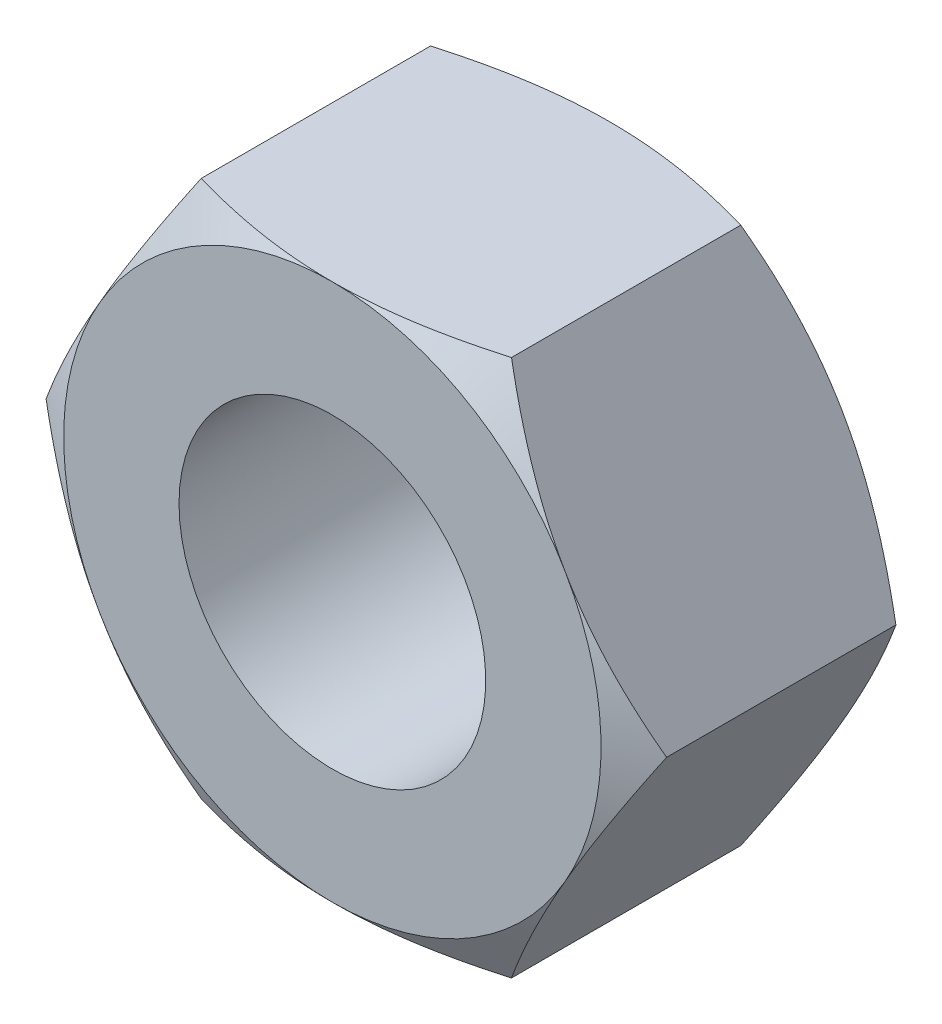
ISO-10303-21;
HEADER;
FILE_DESCRIPTION(('STEP AP214'),'2;1');
FILE_NAME('part.step','',(''),(''),'','','');
FILE_SCHEMA(('AUTOMOTIVE_DESIGN { 1 0 10303 214 1 1 1 1 }'));
ENDSEC;
DATA;
#1=APPLICATION_CONTEXT('core data for automotive mechanical design processes');
#2=APPLICATION_PROTOCOL_DEFINITION('international standard','automotive_design',2000,#1);
#3=PRODUCT_CONTEXT('',#1,'mechanical');
#4=PRODUCT('Part','Part','',(#3));
#5=PRODUCT_RELATED_PRODUCT_CATEGORY('part','',(#4));
#6=PRODUCT_DEFINITION_FORMATION('','',#4);
#7=PRODUCT_DEFINITION_CONTEXT('part definition',#1,'design');
#8=PRODUCT_DEFINITION('design','',#6,#7);
#9=PRODUCT_DEFINITION_SHAPE('','',#8);
#10=(LENGTH_UNIT() NAMED_UNIT(*) SI_UNIT(.MILLI.,.METRE.));
#11=(NAMED_UNIT(*) PLANE_ANGLE_UNIT() SI_UNIT($,.RADIAN.));
#12=(NAMED_UNIT(*) SI_UNIT($,.STERADIAN.) SOLID_ANGLE_UNIT());
#13=UNCERTAINTY_MEASURE_WITH_UNIT(LENGTH_MEASURE(1.E-05),#10,'distance_accuracy_value','');
#14=(GEOMETRIC_REPRESENTATION_CONTEXT(3) GLOBAL_UNCERTAINTY_ASSIGNED_CONTEXT((#13)) GLOBAL_UNIT_ASSIGNED_CONTEXT((#10,
#11,#12)) REPRESENTATION_CONTEXT('',''));
#15=CARTESIAN_POINT('',(0.,0.,0.));
#16=DIRECTION('',(0.,0.,1.));
#17=DIRECTION('',(1.,0.,0.));
#18=AXIS2_PLACEMENT_3D('',#15,#16,#17);
#19=CARTESIAN_POINT('',(-3.21156860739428,5.56259999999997,5.7404));
#20=DIRECTION('',(0.866025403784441,-0.499999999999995,0.));
#21=DIRECTION('',(0.499999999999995,0.866025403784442,0.));
#22=AXIS2_PLACEMENT_3D('',#19,#20,#21);
#23=PLANE('',#22);
#24=CARTESIAN_POINT('',(-3.21145313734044,5.56279999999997,5.24350193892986));
#25=CARTESIAN_POINT('',(-3.2820472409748,5.44052742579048,5.28425379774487));
#26=CARTESIAN_POINT('',(-3.35290455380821,5.3177989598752,5.32315622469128));
#27=CARTESIAN_POINT('',(-3.49519461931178,5.07134533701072,5.39675283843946));
#28=CARTESIAN_POINT('',(-3.56662760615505,4.94761977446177,5.43144520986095));
#29=CARTESIAN_POINT('',(-3.78207031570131,4.57446205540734,5.52852629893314));
#30=CARTESIAN_POINT('',(-3.92693047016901,4.323556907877,5.58374515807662));
#31=CARTESIAN_POINT('',(-4.14371105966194,3.9480819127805,5.64849621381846));
#32=CARTESIAN_POINT('',(-4.2149837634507,3.82463396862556,5.66694200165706));
#33=CARTESIAN_POINT('',(-4.35785122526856,3.57718026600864,5.69787310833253));
#34=CARTESIAN_POINT('',(-4.42944595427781,3.45317455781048,5.71035895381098));
#35=CARTESIAN_POINT('',(-4.57275976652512,3.20494775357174,5.72905197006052));
#36=CARTESIAN_POINT('',(-4.64447861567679,3.08072706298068,5.73526626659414));
#37=CARTESIAN_POINT('',(-4.78797861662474,2.83217777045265,5.74128959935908));
#38=CARTESIAN_POINT('',(-4.85975976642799,2.7078491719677,5.74109883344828));
#39=CARTESIAN_POINT('',(-5.05641945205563,2.36722460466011,5.73177189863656));
#40=CARTESIAN_POINT('',(-5.18123362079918,2.1510401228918,5.71611260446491));
#41=CARTESIAN_POINT('',(-5.43003294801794,1.72010704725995,5.66645567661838));
#42=CARTESIAN_POINT('',(-5.55401723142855,1.50535996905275,5.63244106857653));
#43=CARTESIAN_POINT('',(-5.80331731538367,1.07355955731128,5.54741395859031));
#44=CARTESIAN_POINT('',(-5.92860165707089,0.856560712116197,5.49604118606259));
#45=CARTESIAN_POINT('',(-6.177301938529,0.425799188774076,5.3794455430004));
#46=CARTESIAN_POINT('',(-6.30072106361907,0.21203099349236,5.31425006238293));
#47=CARTESIAN_POINT('',(-6.42325268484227,-0.000199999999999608,5.24350193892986));
#48=B_SPLINE_CURVE_WITH_KNOTS('',3,(#24,#25,#26,#27,#28,#29,#30,#31,#32,#33,#34,#35,#36,#37,#38,
#39,#40,#41,#42,#43,#44,#45,#46,#47),.UNSPECIFIED.,.F.,.F.,(4,2,2,2,2,2,2,2,2,2,2,4),(0.,
0.44082011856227,0.8818296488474,1.76568130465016,2.19678242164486,2.62784543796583,
3.05841812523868,3.48897751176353,4.23854798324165,4.98881282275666,5.75571809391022,
6.52111769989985),.UNSPECIFIED.);
#49=CARTESIAN_POINT('',(-3.21156860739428,5.56259999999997,5.24356860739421));
#50=VERTEX_POINT('',#49);
#51=CARTESIAN_POINT('',(-4.81735291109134,2.78129999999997,5.7404));
#52=VERTEX_POINT('',#51);
#53=EDGE_CURVE('E126',#50,#52,#48,.T.);
#54=ORIENTED_EDGE('',*,*,#53,.F.);
#55=DIRECTION('',(0.,0.,-1.));
#56=VECTOR('',#55,1.);
#57=CARTESIAN_POINT('',(-3.21156860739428,5.56259999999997,5.7404));
#58=LINE('',#57,#56);
#59=CARTESIAN_POINT('',(-3.21156860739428,5.56259999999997,0.496831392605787));
#60=VERTEX_POINT('',#59);
#61=EDGE_CURVE('E225',#50,#60,#58,.T.);
#62=ORIENTED_EDGE('',*,*,#61,.T.);
#63=CARTESIAN_POINT('',(-6.42325268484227,-0.000200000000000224,0.496898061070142));
#64=CARTESIAN_POINT('',(-6.35265858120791,0.122072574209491,0.45614620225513));
#65=CARTESIAN_POINT('',(-6.2818012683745,0.244801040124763,0.417243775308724));
#66=CARTESIAN_POINT('',(-6.13951120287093,0.491254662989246,0.343647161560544));
#67=CARTESIAN_POINT('',(-6.06807821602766,0.614980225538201,0.308954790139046));
#68=CARTESIAN_POINT('',(-5.8526355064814,0.988137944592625,0.211873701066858));
#69=CARTESIAN_POINT('',(-5.7077753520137,1.23904309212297,0.156654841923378));
#70=CARTESIAN_POINT('',(-5.49099476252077,1.61451808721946,0.0919037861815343));
#71=CARTESIAN_POINT('',(-5.41972205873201,1.7379660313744,0.0734579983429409));
#72=CARTESIAN_POINT('',(-5.27685459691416,1.98541973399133,0.0425268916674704));
#73=CARTESIAN_POINT('',(-5.2052598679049,2.10942544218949,0.0300410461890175));
#74=CARTESIAN_POINT('',(-5.06194605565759,2.35765224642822,0.0113480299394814));
#75=CARTESIAN_POINT('',(-4.99022720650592,2.48187293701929,0.00513373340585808));
#76=CARTESIAN_POINT('',(-4.84672720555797,2.73042222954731,-0.000889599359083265));
#77=CARTESIAN_POINT('',(-4.77494605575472,2.85475082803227,-0.000698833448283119));
#78=CARTESIAN_POINT('',(-4.57828637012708,3.19537539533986,0.00862810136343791));
#79=CARTESIAN_POINT('',(-4.45347220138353,3.41155987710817,0.0242873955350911));
#80=CARTESIAN_POINT('',(-4.20467287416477,3.84249295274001,0.0739443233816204));
#81=CARTESIAN_POINT('',(-4.08068859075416,4.05724003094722,0.107958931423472));
#82=CARTESIAN_POINT('',(-3.83138850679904,4.48904044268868,0.19298604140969));
#83=CARTESIAN_POINT('',(-3.70610416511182,4.70603928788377,0.244358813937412));
#84=CARTESIAN_POINT('',(-3.45740388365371,5.13680081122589,0.360954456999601));
#85=CARTESIAN_POINT('',(-3.33398475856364,5.35056900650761,0.426149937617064));
#86=CARTESIAN_POINT('',(-3.21145313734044,5.56279999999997,0.496898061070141));
#87=B_SPLINE_CURVE_WITH_KNOTS('',3,(#63,#64,#65,#66,#67,#68,#69,#70,#71,#72,#73,#74,#75,#76,#77,
#78,#79,#80,#81,#82,#83,#84,#85,#86),.UNSPECIFIED.,.F.,.F.,(4,2,2,2,2,2,2,2,2,2,2,4),(0.,
0.44082011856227,0.8818296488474,1.76568130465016,2.19678242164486,2.62784543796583,
3.05841812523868,3.48897751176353,4.23854798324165,4.98881282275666,5.75571809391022,
6.52111769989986),.UNSPECIFIED.);
#88=CARTESIAN_POINT('',(-4.81735291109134,2.78129999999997,0.));
#89=VERTEX_POINT('',#88);
#90=EDGE_CURVE('E285',#89,#60,#87,.T.);
#91=ORIENTED_EDGE('',*,*,#90,.F.);
#92=CARTESIAN_POINT('',(-6.42313721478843,0.,0.496831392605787));
#93=VERTEX_POINT('',#92);
#94=EDGE_CURVE('E278',#93,#89,#87,.T.);
#95=ORIENTED_EDGE('',*,*,#94,.F.);
#96=DIRECTION('',(0.,0.,-1.));
#97=VECTOR('',#96,1.);
#98=CARTESIAN_POINT('',(-6.42313721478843,0.,5.7404));
#99=LINE('',#98,#97);
#100=CARTESIAN_POINT('',(-6.42313721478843,0.,5.24356860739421));
#101=VERTEX_POINT('',#100);
#102=EDGE_CURVE('E149',#101,#93,#99,.T.);
#103=ORIENTED_EDGE('',*,*,#102,.F.);
#104=EDGE_CURVE('E135',#52,#101,#48,.T.);
#105=ORIENTED_EDGE('',*,*,#104,.F.);
#106=EDGE_LOOP('',(#54,#62,#91,#95,#103,#105));
#107=FACE_BOUND('',#106,.T.);
#108=ADVANCED_FACE('F38',(#107),#23,.F.);
#109=CARTESIAN_POINT('',(-6.42313721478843,0.,5.7404));
#110=DIRECTION('',(0.866025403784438,0.500000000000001,0.));
#111=DIRECTION('',(-0.500000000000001,0.866025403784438,0.));
#112=AXIS2_PLACEMENT_3D('',#109,#110,#111);
#113=PLANE('',#112);
#114=CARTESIAN_POINT('',(-6.42325268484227,0.000200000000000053,5.24350193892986));
#115=CARTESIAN_POINT('',(-6.35265858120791,-0.122072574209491,5.28425379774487));
#116=CARTESIAN_POINT('',(-6.2818012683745,-0.244801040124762,5.32315622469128));
#117=CARTESIAN_POINT('',(-6.13951120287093,-0.491254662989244,5.39675283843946));
#118=CARTESIAN_POINT('',(-6.06807821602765,-0.614980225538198,5.43144520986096));
#119=CARTESIAN_POINT('',(-5.85263550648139,-0.98813794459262,5.52852629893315));
#120=CARTESIAN_POINT('',(-5.70777535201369,-1.23904309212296,5.58374515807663));
#121=CARTESIAN_POINT('',(-5.49099476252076,-1.61451808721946,5.64849621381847));
#122=CARTESIAN_POINT('',(-5.41972205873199,-1.7379660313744,5.66694200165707));
#123=CARTESIAN_POINT('',(-5.27685459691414,-1.98541973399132,5.69787310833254));
#124=CARTESIAN_POINT('',(-5.20525986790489,-2.10942544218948,5.71035895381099));
#125=CARTESIAN_POINT('',(-5.06194605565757,-2.35765224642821,5.72905197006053));
#126=CARTESIAN_POINT('',(-4.9902272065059,-2.48187293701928,5.73526626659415));
#127=CARTESIAN_POINT('',(-4.84672720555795,-2.7304222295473,5.7412895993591));
#128=CARTESIAN_POINT('',(-4.7749460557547,-2.85475082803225,5.7410988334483));
#129=CARTESIAN_POINT('',(-4.57828637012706,-3.19537539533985,5.73177189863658));
#130=CARTESIAN_POINT('',(-4.4534722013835,-3.41155987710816,5.71611260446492));
#131=CARTESIAN_POINT('',(-4.20467287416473,-3.84249295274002,5.66645567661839));
#132=CARTESIAN_POINT('',(-4.08068859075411,-4.05724003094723,5.63244106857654));
#133=CARTESIAN_POINT('',(-3.83138850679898,-4.4890404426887,5.54741395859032));
#134=CARTESIAN_POINT('',(-3.70610416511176,-4.7060392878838,5.4960411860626));
#135=CARTESIAN_POINT('',(-3.45740388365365,-5.13680081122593,5.3794455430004));
#136=CARTESIAN_POINT('',(-3.33398475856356,-5.35056900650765,5.31425006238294));
#137=CARTESIAN_POINT('',(-3.21145313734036,-5.56280000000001,5.24350193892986));
#138=B_SPLINE_CURVE_WITH_KNOTS('',3,(#114,#115,#116,#117,#118,#119,#120,#121,#122,#123,#124,
#125,#126,#127,#128,#129,#130,#131,#132,#133,#134,#135,#136,#137),.UNSPECIFIED.,.F.,.F.,(4,2,2,
2,2,2,2,2,2,2,2,4),(0.,0.44082011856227,0.8818296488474,1.76568130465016,2.19678242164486,
2.62784543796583,3.05841812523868,3.48897751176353,4.23854798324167,4.9888128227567,
5.75571809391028,6.52111769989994),.UNSPECIFIED.);
#139=CARTESIAN_POINT('',(-4.81735291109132,-2.78130000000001,5.7404));
#140=VERTEX_POINT('',#139);
#141=EDGE_CURVE('E141',#101,#140,#138,.T.);
#142=ORIENTED_EDGE('',*,*,#141,.F.);
#143=ORIENTED_EDGE('',*,*,#102,.T.);
#144=CARTESIAN_POINT('',(-3.21145313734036,-5.56280000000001,0.496898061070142));
#145=CARTESIAN_POINT('',(-3.28204724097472,-5.44052742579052,0.45614620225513));
#146=CARTESIAN_POINT('',(-3.35290455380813,-5.31779895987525,0.417243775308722));
#147=CARTESIAN_POINT('',(-3.4951946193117,-5.07134533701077,0.343647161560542));
#148=CARTESIAN_POINT('',(-3.56662760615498,-4.94761977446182,0.308954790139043));
#149=CARTESIAN_POINT('',(-3.78207031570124,-4.57446205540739,0.211873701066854));
#150=CARTESIAN_POINT('',(-3.92693047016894,-4.32355690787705,0.156654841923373));
#151=CARTESIAN_POINT('',(-4.14371105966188,-3.94808191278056,0.0919037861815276));
#152=CARTESIAN_POINT('',(-4.21498376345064,-3.82463396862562,0.0734579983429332));
#153=CARTESIAN_POINT('',(-4.35785122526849,-3.57718026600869,0.0425268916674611));
#154=CARTESIAN_POINT('',(-4.42944595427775,-3.45317455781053,0.0300410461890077));
#155=CARTESIAN_POINT('',(-4.57275976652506,-3.2049477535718,0.0113480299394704));
#156=CARTESIAN_POINT('',(-4.64447861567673,-3.08072706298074,0.00513373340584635));
#157=CARTESIAN_POINT('',(-4.78797861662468,-2.83217777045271,-0.000889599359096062));
#158=CARTESIAN_POINT('',(-4.85975976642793,-2.70784917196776,-0.00069883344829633));
#159=CARTESIAN_POINT('',(-5.05641945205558,-2.36722460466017,0.00862810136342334));
#160=CARTESIAN_POINT('',(-5.18123362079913,-2.15104012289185,0.0242873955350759));
#161=CARTESIAN_POINT('',(-5.4300329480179,-1.72010704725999,0.0739443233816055));
#162=CARTESIAN_POINT('',(-5.55401723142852,-1.50535996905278,0.107958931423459));
#163=CARTESIAN_POINT('',(-5.80331731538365,-1.07355955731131,0.192986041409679));
#164=CARTESIAN_POINT('',(-5.92860165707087,-0.856560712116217,0.244358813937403));
#165=CARTESIAN_POINT('',(-6.17730193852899,-0.425799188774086,0.360954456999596));
#166=CARTESIAN_POINT('',(-6.30072106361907,-0.212030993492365,0.426149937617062));
#167=CARTESIAN_POINT('',(-6.42325268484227,0.000200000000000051,0.496898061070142));
#168=B_SPLINE_CURVE_WITH_KNOTS('',3,(#144,#145,#146,#147,#148,#149,#150,#151,#152,#153,#154,
#155,#156,#157,#158,#159,#160,#161,#162,#163,#164,#165,#166,#167),.UNSPECIFIED.,.F.,.F.,(4,2,2,
2,2,2,2,2,2,2,2,4),(0.,0.440820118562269,0.881829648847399,1.76568130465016,2.19678242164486,
2.62784543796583,3.05841812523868,3.48897751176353,4.23854798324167,4.9888128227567,
5.75571809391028,6.52111769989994),.UNSPECIFIED.);
#169=CARTESIAN_POINT('',(-4.81735291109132,-2.78130000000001,0.));
#170=VERTEX_POINT('',#169);
#171=EDGE_CURVE('E220',#170,#93,#168,.T.);
#172=ORIENTED_EDGE('',*,*,#171,.F.);
#173=CARTESIAN_POINT('',(-3.2115686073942,-5.56260000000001,0.496831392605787));
#174=VERTEX_POINT('',#173);
#175=EDGE_CURVE('E262',#174,#170,#168,.T.);
#176=ORIENTED_EDGE('',*,*,#175,.F.);
#177=DIRECTION('',(0.,0.,-1.));
#178=VECTOR('',#177,1.);
#179=CARTESIAN_POINT('',(-3.2115686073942,-5.56260000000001,5.7404));
#180=LINE('',#179,#178);
#181=CARTESIAN_POINT('',(-3.2115686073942,-5.56260000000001,5.24356860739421));
#182=VERTEX_POINT('',#181);
#183=EDGE_CURVE('E233',#182,#174,#180,.T.);
#184=ORIENTED_EDGE('',*,*,#183,.F.);
#185=EDGE_CURVE('E150',#140,#182,#138,.T.);
#186=ORIENTED_EDGE('',*,*,#185,.F.);
#187=EDGE_LOOP('',(#142,#143,#172,#176,#184,#186));
#188=FACE_BOUND('',#187,.T.);
#189=ADVANCED_FACE('F205',(#188),#113,.F.);
#190=CARTESIAN_POINT('',(-3.2115686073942,-5.56260000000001,5.7404));
#191=DIRECTION('',(0.,1.,0.));
#192=DIRECTION('',(-1.,0.,0.));
#193=AXIS2_PLACEMENT_3D('',#190,#191,#192);
#194=PLANE('',#193);
#195=CARTESIAN_POINT('',(-8.6317104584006,-5.56260000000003,3.02325474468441));
#196=CARTESIAN_POINT('',(-8.38864196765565,-5.56260000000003,3.14118500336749));
#197=CARTESIAN_POINT('',(-8.14501588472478,-5.56260000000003,3.2579856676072));
#198=CARTESIAN_POINT('',(-7.65635188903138,-5.56260000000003,3.48869234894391));
#199=CARTESIAN_POINT('',(-7.4113137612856,-5.56260000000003,3.60259791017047));
#200=CARTESIAN_POINT('',(-6.91826978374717,-5.56260000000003,3.82745050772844));
#201=CARTESIAN_POINT('',(-6.67025504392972,-5.56260000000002,3.93837811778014));
#202=CARTESIAN_POINT('',(-6.17225385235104,-5.56260000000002,4.15569824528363));
#203=CARTESIAN_POINT('',(-5.92226749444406,-5.56260000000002,4.26209097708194));
#204=CARTESIAN_POINT('',(-5.41198451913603,-5.56260000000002,4.47241674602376));
#205=CARTESIAN_POINT('',(-5.15161168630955,-5.56260000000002,4.57616588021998));
#206=CARTESIAN_POINT('',(-4.62782211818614,-5.56260000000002,4.77582417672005));
#207=CARTESIAN_POINT('',(-4.36440504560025,-5.56260000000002,4.87173246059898));
#208=CARTESIAN_POINT('',(-3.83459865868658,-5.56260000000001,5.0531961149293));
#209=CARTESIAN_POINT('',(-3.56821656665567,-5.56260000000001,5.13877236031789));
#210=CARTESIAN_POINT('',(-3.03163215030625,-5.56260000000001,5.29682996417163));
#211=CARTESIAN_POINT('',(-2.76143105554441,-5.56260000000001,5.36931543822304));
#212=CARTESIAN_POINT('',(-2.21848030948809,-5.56260000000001,5.49734982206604));
#213=CARTESIAN_POINT('',(-1.94575167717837,-5.56260000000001,5.55298622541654));
#214=CARTESIAN_POINT('',(-1.39689900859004,-5.56260000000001,5.6441537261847));
#215=CARTESIAN_POINT('',(-1.12077531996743,-5.5626,5.67968686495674));
#216=CARTESIAN_POINT('',(-0.570120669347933,-5.5626,5.72734880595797));
#217=CARTESIAN_POINT('',(-0.2956164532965,-5.5626,5.7397790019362));
#218=CARTESIAN_POINT('',(0.253470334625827,-5.5626,5.74097490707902));
#219=CARTESIAN_POINT('',(0.528052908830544,-5.5626,5.72973981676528));
#220=CARTESIAN_POINT('',(0.993940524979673,-5.5626,5.69139420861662));
#221=CARTESIAN_POINT('',(1.18574418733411,-5.5626,5.66999372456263));
#222=CARTESIAN_POINT('',(1.56794341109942,-5.56259999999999,5.6169736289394));
#223=CARTESIAN_POINT('',(1.75833877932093,-5.56259999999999,5.58535264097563));
#224=CARTESIAN_POINT('',(2.32715060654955,-5.56259999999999,5.47682168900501));
#225=CARTESIAN_POINT('',(2.70299153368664,-5.56259999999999,5.38626249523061));
#226=CARTESIAN_POINT('',(3.26522455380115,-5.56259999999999,5.22922577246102));
#227=CARTESIAN_POINT('',(3.45452696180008,-5.56259999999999,5.17257573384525));
#228=CARTESIAN_POINT('',(3.8312914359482,-5.56259999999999,5.0534011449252));
#229=CARTESIAN_POINT('',(4.01875348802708,-5.56259999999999,4.99087654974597));
#230=CARTESIAN_POINT('',(4.39190060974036,-5.56259999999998,4.86095581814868));
#231=CARTESIAN_POINT('',(4.57758621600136,-5.56259999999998,4.79356120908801));
#232=CARTESIAN_POINT('',(4.94741588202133,-5.56259999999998,4.65469270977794));
#233=CARTESIAN_POINT('',(5.13155997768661,-5.56259999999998,4.58321891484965));
#234=CARTESIAN_POINT('',(5.63445010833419,-5.56259999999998,4.3826490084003));
#235=CARTESIAN_POINT('',(5.95181868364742,-5.56259999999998,4.25010227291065));
#236=CARTESIAN_POINT('',(6.58329059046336,-5.56259999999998,3.97741963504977));
#237=CARTESIAN_POINT('',(6.89739355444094,-5.56259999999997,3.83728288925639));
#238=CARTESIAN_POINT('',(7.52310486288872,-5.56259999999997,3.55125530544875));
#239=CARTESIAN_POINT('',(7.83471220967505,-5.56259999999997,3.40536229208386));
#240=CARTESIAN_POINT('',(8.45582986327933,-5.56259999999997,3.10922556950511));
#241=CARTESIAN_POINT('',(8.76534025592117,-5.56259999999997,2.95898203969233));
#242=CARTESIAN_POINT('',(9.38317832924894,-5.56259999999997,2.65486700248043));
#243=CARTESIAN_POINT('',(9.69150336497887,-5.56259999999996,2.50099013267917));
#244=CARTESIAN_POINT('',(10.3067997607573,-5.56259999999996,2.19055134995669));
#245=CARTESIAN_POINT('',(10.613771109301,-5.56259999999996,2.03398941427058));
#246=CARTESIAN_POINT('',(11.2265387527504,-5.56259999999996,1.71874985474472));
#247=CARTESIAN_POINT('',(11.5323352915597,-5.56259999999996,1.56007270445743));
#248=CARTESIAN_POINT('',(12.1430151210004,-5.56259999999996,1.24096973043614));
#249=CARTESIAN_POINT('',(12.4478984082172,-5.56259999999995,1.08054390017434));
#250=CARTESIAN_POINT('',(13.2958613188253,-5.56259999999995,0.631811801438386));
#251=CARTESIAN_POINT('',(13.8381143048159,-5.56259999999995,0.341943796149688));
#252=CARTESIAN_POINT('',(14.9208810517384,-5.56259999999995,-0.241095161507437));
#253=CARTESIAN_POINT('',(15.4613947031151,-5.56259999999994,-0.534266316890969));
#254=CARTESIAN_POINT('',(16.539328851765,-5.56259999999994,-1.12209966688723));
#255=CARTESIAN_POINT('',(17.0767536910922,-5.56259999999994,-1.41675390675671));
#256=CARTESIAN_POINT('',(18.1505187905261,-5.56259999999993,-2.00793441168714));
#257=CARTESIAN_POINT('',(18.6868591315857,-5.56259999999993,-2.30446052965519));
#258=CARTESIAN_POINT('',(19.2228206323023,-5.56259999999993,-2.60166504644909));
#259=B_SPLINE_CURVE_WITH_KNOTS('',3,(#195,#196,#197,#198,#199,#200,#201,#202,#203,#204,#205,
#206,#207,#208,#209,#210,#211,#212,#213,#214,#215,#216,#217,#218,#219,#220,#221,#222,#223,#224,
#225,#226,#227,#228,#229,#230,#231,#232,#233,#234,#235,#236,#237,#238,#239,#240,#241,#242,#243,
#244,#245,#246,#247,#248,#249,#250,#251,#252,#253,#254,#255,#256,#257,#258),.UNSPECIFIED.,.F.,
.F.,(4,2,2,2,2,2,2,2,2,2,2,2,2,2,2,2,2,2,2,2,2,2,2,2,2,2,2,2,2,2,2,4),(0.,0.810508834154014,
1.62114451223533,2.43618252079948,3.25118196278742,4.09192980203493,4.93277170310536,
5.77188527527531,6.61073457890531,7.44515012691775,8.27948093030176,9.10284877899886,
9.9262444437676,10.5049457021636,11.0837249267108,12.2418870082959,12.8346280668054,
13.4273736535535,14.0199341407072,14.6124807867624,15.6441365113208,16.6759071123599,
17.7080714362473,18.7401932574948,19.7739475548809,20.8077106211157,21.8412460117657,
22.874785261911,24.7193693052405,26.5640673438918,28.4027634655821,30.241316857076),.UNSPECIFIED.);
#260=CARTESIAN_POINT('',(0.,-5.5626,5.7404));
#261=VERTEX_POINT('',#260);
#262=EDGE_CURVE('E199',#182,#261,#259,.T.);
#263=ORIENTED_EDGE('',*,*,#262,.F.);
#264=ORIENTED_EDGE('',*,*,#183,.T.);
#265=CARTESIAN_POINT('',(-8.6317104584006,-5.56260000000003,2.71714525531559));
#266=CARTESIAN_POINT('',(-8.38864196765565,-5.56260000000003,2.59921499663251));
#267=CARTESIAN_POINT('',(-8.14501588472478,-5.56260000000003,2.4824143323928));
#268=CARTESIAN_POINT('',(-7.65635188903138,-5.56260000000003,2.25170765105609));
#269=CARTESIAN_POINT('',(-7.4113137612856,-5.56260000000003,2.13780208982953));
#270=CARTESIAN_POINT('',(-6.91826978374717,-5.56260000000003,1.91294949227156));
#271=CARTESIAN_POINT('',(-6.67025504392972,-5.56260000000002,1.80202188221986));
#272=CARTESIAN_POINT('',(-6.17225385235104,-5.56260000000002,1.58470175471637));
#273=CARTESIAN_POINT('',(-5.92226749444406,-5.56260000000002,1.47830902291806));
#274=CARTESIAN_POINT('',(-5.41198451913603,-5.56260000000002,1.26798325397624));
#275=CARTESIAN_POINT('',(-5.15161168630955,-5.56260000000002,1.16423411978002));
#276=CARTESIAN_POINT('',(-4.62782211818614,-5.56260000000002,0.964575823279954));
#277=CARTESIAN_POINT('',(-4.36440504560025,-5.56260000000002,0.868667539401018));
#278=CARTESIAN_POINT('',(-3.83459865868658,-5.56260000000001,0.687203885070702));
#279=CARTESIAN_POINT('',(-3.56821656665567,-5.56260000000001,0.601627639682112));
#280=CARTESIAN_POINT('',(-3.03163215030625,-5.56260000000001,0.443570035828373));
#281=CARTESIAN_POINT('',(-2.76143105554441,-5.56260000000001,0.371084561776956));
#282=CARTESIAN_POINT('',(-2.21848030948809,-5.56260000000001,0.243050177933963));
#283=CARTESIAN_POINT('',(-1.94575167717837,-5.56260000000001,0.187413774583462));
#284=CARTESIAN_POINT('',(-1.39689900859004,-5.56260000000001,0.0962462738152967));
#285=CARTESIAN_POINT('',(-1.12077531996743,-5.5626,0.0607131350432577));
#286=CARTESIAN_POINT('',(-0.570120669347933,-5.5626,0.0130511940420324));
#287=CARTESIAN_POINT('',(-0.2956164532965,-5.5626,0.000620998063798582));
#288=CARTESIAN_POINT('',(0.253470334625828,-5.5626,-0.000574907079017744));
#289=CARTESIAN_POINT('',(0.528052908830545,-5.5626,0.0106601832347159));
#290=CARTESIAN_POINT('',(0.993940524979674,-5.5626,0.0490057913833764));
#291=CARTESIAN_POINT('',(1.18574418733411,-5.5626,0.0704062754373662));
#292=CARTESIAN_POINT('',(1.56794341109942,-5.56259999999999,0.123426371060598));
#293=CARTESIAN_POINT('',(1.75833877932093,-5.56259999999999,0.155047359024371));
#294=CARTESIAN_POINT('',(2.32715060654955,-5.56259999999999,0.263578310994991));
#295=CARTESIAN_POINT('',(2.70299153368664,-5.56259999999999,0.354137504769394));
#296=CARTESIAN_POINT('',(3.26522455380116,-5.56259999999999,0.511174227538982));
#297=CARTESIAN_POINT('',(3.45452696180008,-5.56259999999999,0.567824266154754));
#298=CARTESIAN_POINT('',(3.8312914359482,-5.56259999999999,0.686998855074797));
#299=CARTESIAN_POINT('',(4.01875348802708,-5.56259999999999,0.749523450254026));
#300=CARTESIAN_POINT('',(4.39190060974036,-5.56259999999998,0.879444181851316));
#301=CARTESIAN_POINT('',(4.57758621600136,-5.56259999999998,0.94683879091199));
#302=CARTESIAN_POINT('',(4.94741588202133,-5.56259999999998,1.08570729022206));
#303=CARTESIAN_POINT('',(5.13155997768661,-5.56259999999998,1.15718108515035));
#304=CARTESIAN_POINT('',(5.63445010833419,-5.56259999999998,1.35775099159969));
#305=CARTESIAN_POINT('',(5.95181868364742,-5.56259999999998,1.49029772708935));
#306=CARTESIAN_POINT('',(6.58329059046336,-5.56259999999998,1.76298036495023));
#307=CARTESIAN_POINT('',(6.89739355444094,-5.56259999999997,1.90311711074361));
#308=CARTESIAN_POINT('',(7.52310486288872,-5.56259999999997,2.18914469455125));
#309=CARTESIAN_POINT('',(7.83471220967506,-5.56259999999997,2.33503770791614));
#310=CARTESIAN_POINT('',(8.45582986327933,-5.56259999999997,2.63117443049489));
#311=CARTESIAN_POINT('',(8.76534025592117,-5.56259999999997,2.78141796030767));
#312=CARTESIAN_POINT('',(9.38317832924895,-5.56259999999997,3.08553299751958));
#313=CARTESIAN_POINT('',(9.69150336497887,-5.56259999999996,3.23940986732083));
#314=CARTESIAN_POINT('',(10.3067997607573,-5.56259999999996,3.54984865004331));
#315=CARTESIAN_POINT('',(10.613771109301,-5.56259999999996,3.70641058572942));
#316=CARTESIAN_POINT('',(11.2265387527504,-5.56259999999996,4.02165014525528));
#317=CARTESIAN_POINT('',(11.5323352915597,-5.56259999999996,4.18032729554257));
#318=CARTESIAN_POINT('',(12.1430151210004,-5.56259999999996,4.49943026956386));
#319=CARTESIAN_POINT('',(12.4478984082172,-5.56259999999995,4.65985609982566));
#320=CARTESIAN_POINT('',(13.2958613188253,-5.56259999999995,5.10858819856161));
#321=CARTESIAN_POINT('',(13.8381143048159,-5.56259999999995,5.39845620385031));
#322=CARTESIAN_POINT('',(14.9208810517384,-5.56259999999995,5.98149516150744));
#323=CARTESIAN_POINT('',(15.4613947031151,-5.56259999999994,6.27466631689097));
#324=CARTESIAN_POINT('',(16.539328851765,-5.56259999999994,6.86249966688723));
#325=CARTESIAN_POINT('',(17.0767536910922,-5.56259999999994,7.15715390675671));
#326=CARTESIAN_POINT('',(18.1505187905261,-5.56259999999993,7.74833441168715));
#327=CARTESIAN_POINT('',(18.6868591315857,-5.56259999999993,8.04486052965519));
#328=CARTESIAN_POINT('',(19.2228206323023,-5.56259999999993,8.34206504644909));
#329=B_SPLINE_CURVE_WITH_KNOTS('',3,(#265,#266,#267,#268,#269,#270,#271,#272,#273,#274,#275,
#276,#277,#278,#279,#280,#281,#282,#283,#284,#285,#286,#287,#288,#289,#290,#291,#292,#293,#294,
#295,#296,#297,#298,#299,#300,#301,#302,#303,#304,#305,#306,#307,#308,#309,#310,#311,#312,#313,
#314,#315,#316,#317,#318,#319,#320,#321,#322,#323,#324,#325,#326,#327,#328),.UNSPECIFIED.,.F.,
.F.,(4,2,2,2,2,2,2,2,2,2,2,2,2,2,2,2,2,2,2,2,2,2,2,2,2,2,2,2,2,2,2,4),(0.,0.810508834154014,
1.62114451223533,2.43618252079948,3.25118196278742,4.09192980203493,4.93277170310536,
5.77188527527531,6.61073457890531,7.44515012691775,8.27948093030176,9.10284877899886,
9.9262444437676,10.5049457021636,11.0837249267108,12.2418870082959,12.8346280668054,
13.4273736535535,14.0199341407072,14.6124807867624,15.6441365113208,16.6759071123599,
17.7080714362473,18.7401932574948,19.7739475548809,20.8077106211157,21.8412460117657,
22.874785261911,24.7193693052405,26.5640673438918,28.4027634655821,30.241316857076),.UNSPECIFIED.);
#330=CARTESIAN_POINT('',(0.,-5.5626,0.));
#331=VERTEX_POINT('',#330);
#332=EDGE_CURVE('E211',#331,#174,#329,.F.);
#333=ORIENTED_EDGE('',*,*,#332,.F.);
#334=CARTESIAN_POINT('',(3.21156860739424,-5.56259999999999,0.496831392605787));
#335=VERTEX_POINT('',#334);
#336=EDGE_CURVE('E218',#335,#331,#329,.F.);
#337=ORIENTED_EDGE('',*,*,#336,.F.);
#338=DIRECTION('',(0.,0.,-1.));
#339=VECTOR('',#338,1.);
#340=CARTESIAN_POINT('',(3.21156860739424,-5.56259999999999,5.7404));
#341=LINE('',#340,#339);
#342=CARTESIAN_POINT('',(3.21156860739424,-5.56259999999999,5.24356860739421));
#343=VERTEX_POINT('',#342);
#344=EDGE_CURVE('E231',#343,#335,#341,.T.);
#345=ORIENTED_EDGE('',*,*,#344,.F.);
#346=EDGE_CURVE('E194',#261,#343,#259,.T.);
#347=ORIENTED_EDGE('',*,*,#346,.F.);
#348=EDGE_LOOP('',(#263,#264,#333,#337,#345,#347));
#349=FACE_BOUND('',#348,.T.);
#350=ADVANCED_FACE('F201',(#349),#194,.F.);
#351=CARTESIAN_POINT('',(3.21156860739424,-5.56259999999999,5.7404));
#352=DIRECTION('',(-0.866025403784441,0.499999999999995,0.));
#353=DIRECTION('',(-0.499999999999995,-0.866025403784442,0.));
#354=AXIS2_PLACEMENT_3D('',#351,#352,#353);
#355=PLANE('',#354);
#356=CARTESIAN_POINT('',(3.2114531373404,-5.56279999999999,5.24350193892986));
#357=CARTESIAN_POINT('',(3.28204724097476,-5.4405274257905,5.28425379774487));
#358=CARTESIAN_POINT('',(3.35290455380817,-5.31779895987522,5.32315622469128));
#359=CARTESIAN_POINT('',(3.49519461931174,-5.07134533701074,5.39675283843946));
#360=CARTESIAN_POINT('',(3.56662760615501,-4.94761977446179,5.43144520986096));
#361=CARTESIAN_POINT('',(3.78207031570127,-4.57446205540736,5.52852629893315));
#362=CARTESIAN_POINT('',(3.92693047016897,-4.32355690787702,5.58374515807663));
#363=CARTESIAN_POINT('',(4.1437110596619,-3.94808191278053,5.64849621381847));
#364=CARTESIAN_POINT('',(4.21498376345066,-3.82463396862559,5.66694200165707));
#365=CARTESIAN_POINT('',(4.35785122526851,-3.57718026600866,5.69787310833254));
#366=CARTESIAN_POINT('',(4.42944595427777,-3.4531745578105,5.71035895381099));
#367=CARTESIAN_POINT('',(4.57275976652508,-3.20494775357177,5.72905197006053));
#368=CARTESIAN_POINT('',(4.64447861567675,-3.0807270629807,5.73526626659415));
#369=CARTESIAN_POINT('',(4.7879786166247,-2.83217777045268,5.7412895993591));
#370=CARTESIAN_POINT('',(4.85975976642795,-2.70784917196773,5.7410988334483));
#371=CARTESIAN_POINT('',(5.05641945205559,-2.36722460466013,5.73177189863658));
#372=CARTESIAN_POINT('',(5.18123362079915,-2.15104012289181,5.71611260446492));
#373=CARTESIAN_POINT('',(5.43003294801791,-1.72010704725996,5.66645567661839));
#374=CARTESIAN_POINT('',(5.55401723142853,-1.50535996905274,5.63244106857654));
#375=CARTESIAN_POINT('',(5.80331731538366,-1.07355955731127,5.54741395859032));
#376=CARTESIAN_POINT('',(5.92860165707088,-0.856560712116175,5.4960411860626));
#377=CARTESIAN_POINT('',(6.17730193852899,-0.425799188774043,5.3794455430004));
#378=CARTESIAN_POINT('',(6.30072106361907,-0.212030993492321,5.31425006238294));
#379=CARTESIAN_POINT('',(6.42325268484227,0.000200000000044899,5.24350193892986));
#380=B_SPLINE_CURVE_WITH_KNOTS('',3,(#356,#357,#358,#359,#360,#361,#362,#363,#364,#365,#366,
#367,#368,#369,#370,#371,#372,#373,#374,#375,#376,#377,#378,#379),.UNSPECIFIED.,.F.,.F.,(4,2,2,
2,2,2,2,2,2,2,2,4),(0.,0.44082011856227,0.8818296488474,1.76568130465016,2.19678242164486,
2.62784543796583,3.05841812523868,3.48897751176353,4.23854798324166,4.9888128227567,
5.75571809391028,6.52111769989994),.UNSPECIFIED.);
#381=CARTESIAN_POINT('',(4.81735291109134,-2.78129999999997,5.7404));
#382=VERTEX_POINT('',#381);
#383=EDGE_CURVE('E200',#343,#382,#380,.T.);
#384=ORIENTED_EDGE('',*,*,#383,.F.);
#385=ORIENTED_EDGE('',*,*,#344,.T.);
#386=CARTESIAN_POINT('',(6.42325268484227,0.000200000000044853,0.496898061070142));
#387=CARTESIAN_POINT('',(6.35265858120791,-0.122072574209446,0.45614620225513));
#388=CARTESIAN_POINT('',(6.2818012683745,-0.244801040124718,0.417243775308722));
#389=CARTESIAN_POINT('',(6.13951120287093,-0.491254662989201,0.343647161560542));
#390=CARTESIAN_POINT('',(6.06807821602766,-0.614980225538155,0.308954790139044));
#391=CARTESIAN_POINT('',(5.8526355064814,-0.98813794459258,0.211873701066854));
#392=CARTESIAN_POINT('',(5.7077753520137,-1.23904309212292,0.156654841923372));
#393=CARTESIAN_POINT('',(5.49099476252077,-1.61451808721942,0.0919037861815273));
#394=CARTESIAN_POINT('',(5.41972205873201,-1.73796603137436,0.0734579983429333));
#395=CARTESIAN_POINT('',(5.27685459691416,-1.98541973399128,0.0425268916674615));
#396=CARTESIAN_POINT('',(5.2052598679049,-2.10942544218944,0.0300410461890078));
#397=CARTESIAN_POINT('',(5.06194605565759,-2.35765224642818,0.0113480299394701));
#398=CARTESIAN_POINT('',(4.99022720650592,-2.48187293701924,0.00513373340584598));
#399=CARTESIAN_POINT('',(4.84672720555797,-2.73042222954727,-0.000889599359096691));
#400=CARTESIAN_POINT('',(4.77494605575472,-2.85475082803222,-0.000698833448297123));
#401=CARTESIAN_POINT('',(4.57828637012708,-3.19537539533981,0.00862810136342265));
#402=CARTESIAN_POINT('',(4.45347220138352,-3.41155987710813,0.0242873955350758));
#403=CARTESIAN_POINT('',(4.20467287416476,-3.84249295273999,0.0739443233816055));
#404=CARTESIAN_POINT('',(4.08068859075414,-4.0572400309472,0.107958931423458));
#405=CARTESIAN_POINT('',(3.83138850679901,-4.48904044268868,0.192986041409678));
#406=CARTESIAN_POINT('',(3.70610416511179,-4.70603928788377,0.244358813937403));
#407=CARTESIAN_POINT('',(3.45740388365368,-5.1368008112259,0.360954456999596));
#408=CARTESIAN_POINT('',(3.3339847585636,-5.35056900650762,0.426149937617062));
#409=CARTESIAN_POINT('',(3.2114531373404,-5.56279999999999,0.496898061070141));
#410=B_SPLINE_CURVE_WITH_KNOTS('',3,(#386,#387,#388,#389,#390,#391,#392,#393,#394,#395,#396,
#397,#398,#399,#400,#401,#402,#403,#404,#405,#406,#407,#408,#409),.UNSPECIFIED.,.F.,.F.,(4,2,2,
2,2,2,2,2,2,2,2,4),(0.,0.44082011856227,0.8818296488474,1.76568130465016,2.19678242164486,
2.62784543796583,3.05841812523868,3.48897751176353,4.23854798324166,4.9888128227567,
5.75571809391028,6.52111769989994),.UNSPECIFIED.);
#411=CARTESIAN_POINT('',(4.81735291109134,-2.78129999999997,0.));
#412=VERTEX_POINT('',#411);
#413=EDGE_CURVE('E219',#412,#335,#410,.T.);
#414=ORIENTED_EDGE('',*,*,#413,.F.);
#415=CARTESIAN_POINT('',(6.42313721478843,0.,0.496831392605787));
#416=VERTEX_POINT('',#415);
#417=EDGE_CURVE('E275',#416,#412,#410,.T.);
#418=ORIENTED_EDGE('',*,*,#417,.F.);
#419=DIRECTION('',(0.,0.,-1.));
#420=VECTOR('',#419,1.);
#421=CARTESIAN_POINT('',(6.42313721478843,0.,5.7404));
#422=LINE('',#421,#420);
#423=CARTESIAN_POINT('',(6.42313721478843,0.,5.24356860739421));
#424=VERTEX_POINT('',#423);
#425=EDGE_CURVE('E229',#424,#416,#422,.T.);
#426=ORIENTED_EDGE('',*,*,#425,.F.);
#427=EDGE_CURVE('E189',#382,#424,#380,.T.);
#428=ORIENTED_EDGE('',*,*,#427,.F.);
#429=EDGE_LOOP('',(#384,#385,#414,#418,#426,#428));
#430=FACE_BOUND('',#429,.T.);
#431=ADVANCED_FACE('F204',(#430),#355,.F.);
#432=CARTESIAN_POINT('',(6.42313721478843,0.,5.7404));
#433=DIRECTION('',(-0.866025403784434,-0.500000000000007,0.));
#434=DIRECTION('',(0.500000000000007,-0.866025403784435,0.));
#435=AXIS2_PLACEMENT_3D('',#432,#433,#434);
#436=PLANE('',#435);
#437=CARTESIAN_POINT('',(6.42325268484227,-0.000199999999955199,5.24350193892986));
#438=CARTESIAN_POINT('',(6.35265858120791,0.122072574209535,5.28425379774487));
#439=CARTESIAN_POINT('',(6.2818012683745,0.244801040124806,5.32315622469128));
#440=CARTESIAN_POINT('',(6.13951120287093,0.491254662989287,5.39675283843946));
#441=CARTESIAN_POINT('',(6.06807821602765,0.61498022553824,5.43144520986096));
#442=CARTESIAN_POINT('',(5.85263550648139,0.988137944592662,5.52852629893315));
#443=CARTESIAN_POINT('',(5.70777535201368,1.239043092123,5.58374515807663));
#444=CARTESIAN_POINT('',(5.49099476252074,1.61451808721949,5.64849621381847));
#445=CARTESIAN_POINT('',(5.41972205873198,1.73796603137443,5.66694200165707));
#446=CARTESIAN_POINT('',(5.27685459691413,1.98541973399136,5.69787310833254));
#447=CARTESIAN_POINT('',(5.20525986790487,2.10942544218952,5.71035895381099));
#448=CARTESIAN_POINT('',(5.06194605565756,2.35765224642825,5.72905197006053));
#449=CARTESIAN_POINT('',(4.99022720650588,2.48187293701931,5.73526626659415));
#450=CARTESIAN_POINT('',(4.84672720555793,2.73042222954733,5.7412895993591));
#451=CARTESIAN_POINT('',(4.77494605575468,2.85475082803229,5.7410988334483));
#452=CARTESIAN_POINT('',(4.57828637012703,3.19537539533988,5.73177189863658));
#453=CARTESIAN_POINT('',(4.45347220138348,3.41155987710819,5.71611260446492));
#454=CARTESIAN_POINT('',(4.20467287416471,3.84249295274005,5.6664556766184));
#455=CARTESIAN_POINT('',(4.08068859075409,4.05724003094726,5.63244106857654));
#456=CARTESIAN_POINT('',(3.83138850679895,4.48904044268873,5.54741395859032));
#457=CARTESIAN_POINT('',(3.70610416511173,4.70603928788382,5.4960411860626));
#458=CARTESIAN_POINT('',(3.45740388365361,5.13680081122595,5.3794455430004));
#459=CARTESIAN_POINT('',(3.33398475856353,5.35056900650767,5.31425006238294));
#460=CARTESIAN_POINT('',(3.21145313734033,5.56280000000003,5.24350193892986));
#461=B_SPLINE_CURVE_WITH_KNOTS('',3,(#437,#438,#439,#440,#441,#442,#443,#444,#445,#446,#447,
#448,#449,#450,#451,#452,#453,#454,#455,#456,#457,#458,#459,#460),.UNSPECIFIED.,.F.,.F.,(4,2,2,
2,2,2,2,2,2,2,2,4),(0.,0.44082011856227,0.881829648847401,1.76568130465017,2.19678242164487,
2.62784543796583,3.05841812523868,3.48897751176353,4.23854798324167,4.9888128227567,
5.75571809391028,6.52111769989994),.UNSPECIFIED.);
#462=CARTESIAN_POINT('',(4.8173529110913,2.78130000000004,5.7404));
#463=VERTEX_POINT('',#462);
#464=EDGE_CURVE('E478',#424,#463,#461,.T.);
#465=ORIENTED_EDGE('',*,*,#464,.F.);
#466=ORIENTED_EDGE('',*,*,#425,.T.);
#467=CARTESIAN_POINT('',(3.21145313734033,5.56280000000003,0.496898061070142));
#468=CARTESIAN_POINT('',(3.28204724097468,5.44052742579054,0.456146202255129));
#469=CARTESIAN_POINT('',(3.3529045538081,5.31779895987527,0.417243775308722));
#470=CARTESIAN_POINT('',(3.49519461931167,5.07134533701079,0.343647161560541));
#471=CARTESIAN_POINT('',(3.56662760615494,4.94761977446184,0.308954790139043));
#472=CARTESIAN_POINT('',(3.7820703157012,4.57446205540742,0.211873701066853));
#473=CARTESIAN_POINT('',(3.92693047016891,4.32355690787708,0.156654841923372));
#474=CARTESIAN_POINT('',(4.14371105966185,3.94808191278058,0.0919037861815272));
#475=CARTESIAN_POINT('',(4.21498376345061,3.82463396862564,0.0734579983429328));
#476=CARTESIAN_POINT('',(4.35785122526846,3.57718026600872,0.0425268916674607));
#477=CARTESIAN_POINT('',(4.42944595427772,3.45317455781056,0.0300410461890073));
#478=CARTESIAN_POINT('',(4.57275976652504,3.20494775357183,0.0113480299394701));
#479=CARTESIAN_POINT('',(4.64447861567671,3.08072706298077,0.00513373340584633));
#480=CARTESIAN_POINT('',(4.78797861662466,2.83217777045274,-0.00088959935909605));
#481=CARTESIAN_POINT('',(4.85975976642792,2.70784917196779,-0.000698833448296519));
#482=CARTESIAN_POINT('',(5.05641945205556,2.3672246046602,0.00862810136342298));
#483=CARTESIAN_POINT('',(5.18123362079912,2.15104012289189,0.0242873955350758));
#484=CARTESIAN_POINT('',(5.43003294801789,1.72010704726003,0.0739443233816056));
#485=CARTESIAN_POINT('',(5.55401723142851,1.50535996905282,0.107958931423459));
#486=CARTESIAN_POINT('',(5.80331731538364,1.07355955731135,0.192986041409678));
#487=CARTESIAN_POINT('',(5.92860165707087,0.856560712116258,0.244358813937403));
#488=CARTESIAN_POINT('',(6.17730193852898,0.425799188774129,0.360954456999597));
#489=CARTESIAN_POINT('',(6.30072106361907,0.212030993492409,0.426149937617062));
#490=CARTESIAN_POINT('',(6.42325268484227,-0.000199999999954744,0.496898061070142));
#491=B_SPLINE_CURVE_WITH_KNOTS('',3,(#467,#468,#469,#470,#471,#472,#473,#474,#475,#476,#477,
#478,#479,#480,#481,#482,#483,#484,#485,#486,#487,#488,#489,#490),.UNSPECIFIED.,.F.,.F.,(4,2,2,
2,2,2,2,2,2,2,2,4),(0.,0.44082011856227,0.8818296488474,1.76568130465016,2.19678242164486,
2.62784543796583,3.05841812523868,3.48897751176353,4.23854798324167,4.9888128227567,
5.75571809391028,6.52111769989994),.UNSPECIFIED.);
#492=CARTESIAN_POINT('',(4.8173529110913,2.78130000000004,0.));
#493=VERTEX_POINT('',#492);
#494=EDGE_CURVE('E276',#493,#416,#491,.T.);
#495=ORIENTED_EDGE('',*,*,#494,.F.);
#496=CARTESIAN_POINT('',(3.21156860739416,5.56260000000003,0.496831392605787));
#497=VERTEX_POINT('',#496);
#498=EDGE_CURVE('E280',#497,#493,#491,.T.);
#499=ORIENTED_EDGE('',*,*,#498,.F.);
#500=DIRECTION('',(0.,0.,-1.));
#501=VECTOR('',#500,1.);
#502=CARTESIAN_POINT('',(3.21156860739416,5.56260000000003,5.7404));
#503=LINE('',#502,#501);
#504=CARTESIAN_POINT('',(3.21156860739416,5.56260000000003,5.24356860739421));
#505=VERTEX_POINT('',#504);
#506=EDGE_CURVE('E227',#505,#497,#503,.T.);
#507=ORIENTED_EDGE('',*,*,#506,.F.);
#508=EDGE_CURVE('E183',#463,#505,#461,.T.);
#509=ORIENTED_EDGE('',*,*,#508,.F.);
#510=EDGE_LOOP('',(#465,#466,#495,#499,#507,#509));
#511=FACE_BOUND('',#510,.T.);
#512=ADVANCED_FACE('F298',(#511),#436,.F.);
#513=CARTESIAN_POINT('',(3.21156860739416,5.56260000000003,5.7404));
#514=DIRECTION('',(0.,-1.,0.));
#515=DIRECTION('',(1.,0.,0.));
#516=AXIS2_PLACEMENT_3D('',#513,#514,#515);
#517=PLANE('',#516);
#518=CARTESIAN_POINT('',(-8.63171045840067,5.56259999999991,3.02325474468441));
#519=CARTESIAN_POINT('',(-8.38864196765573,5.56259999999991,3.14118500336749));
#520=CARTESIAN_POINT('',(-8.14501588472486,5.56259999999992,3.2579856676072));
#521=CARTESIAN_POINT('',(-7.65635188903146,5.56259999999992,3.48869234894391));
#522=CARTESIAN_POINT('',(-7.41131376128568,5.56259999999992,3.60259791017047));
#523=CARTESIAN_POINT('',(-6.91826978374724,5.56259999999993,3.82745050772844));
#524=CARTESIAN_POINT('',(-6.6702550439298,5.56259999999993,3.93837811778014));
#525=CARTESIAN_POINT('',(-6.17225385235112,5.56259999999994,4.15569824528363));
#526=CARTESIAN_POINT('',(-5.92226749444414,5.56259999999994,4.26209097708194));
#527=CARTESIAN_POINT('',(-5.41198451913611,5.56259999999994,4.47241674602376));
#528=CARTESIAN_POINT('',(-5.15161168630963,5.56259999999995,4.57616588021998));
#529=CARTESIAN_POINT('',(-4.62782211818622,5.56259999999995,4.77582417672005));
#530=CARTESIAN_POINT('',(-4.36440504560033,5.56259999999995,4.87173246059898));
#531=CARTESIAN_POINT('',(-3.83459865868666,5.56259999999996,5.0531961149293));
#532=CARTESIAN_POINT('',(-3.56821656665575,5.56259999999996,5.13877236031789));
#533=CARTESIAN_POINT('',(-3.03163215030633,5.56259999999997,5.29682996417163));
#534=CARTESIAN_POINT('',(-2.76143105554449,5.56259999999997,5.36931543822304));
#535=CARTESIAN_POINT('',(-2.21848030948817,5.56259999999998,5.49734982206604));
#536=CARTESIAN_POINT('',(-1.94575167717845,5.56259999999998,5.55298622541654));
#537=CARTESIAN_POINT('',(-1.39689900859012,5.56259999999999,5.6441537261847));
#538=CARTESIAN_POINT('',(-1.12077531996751,5.56259999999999,5.67968686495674));
#539=CARTESIAN_POINT('',(-0.570120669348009,5.56259999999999,5.72734880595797));
#540=CARTESIAN_POINT('',(-0.295616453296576,5.5626,5.7397790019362));
#541=CARTESIAN_POINT('',(0.253470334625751,5.5626,5.74097490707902));
#542=CARTESIAN_POINT('',(0.528052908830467,5.56260000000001,5.72973981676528));
#543=CARTESIAN_POINT('',(0.993940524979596,5.56260000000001,5.69139420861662));
#544=CARTESIAN_POINT('',(1.18574418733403,5.56260000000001,5.66999372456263));
#545=CARTESIAN_POINT('',(1.56794341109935,5.56260000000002,5.6169736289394));
#546=CARTESIAN_POINT('',(1.75833877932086,5.56260000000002,5.58535264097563));
#547=CARTESIAN_POINT('',(2.32715060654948,5.56260000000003,5.47682168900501));
#548=CARTESIAN_POINT('',(2.70299153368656,5.56260000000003,5.38626249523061));
#549=CARTESIAN_POINT('',(3.26522455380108,5.56260000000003,5.22922577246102));
#550=CARTESIAN_POINT('',(3.4545269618,5.56260000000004,5.17257573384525));
#551=CARTESIAN_POINT('',(3.83129143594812,5.56260000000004,5.0534011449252));
#552=CARTESIAN_POINT('',(4.018753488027,5.56260000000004,4.99087654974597));
#553=CARTESIAN_POINT('',(4.39190060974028,5.56260000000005,4.86095581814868));
#554=CARTESIAN_POINT('',(4.57758621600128,5.56260000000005,4.79356120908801));
#555=CARTESIAN_POINT('',(4.94741588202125,5.56260000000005,4.65469270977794));
#556=CARTESIAN_POINT('',(5.13155997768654,5.56260000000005,4.58321891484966));
#557=CARTESIAN_POINT('',(5.63445010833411,5.56260000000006,4.38264900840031));
#558=CARTESIAN_POINT('',(5.95181868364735,5.56260000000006,4.25010227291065));
#559=CARTESIAN_POINT('',(6.58329059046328,5.56260000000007,3.97741963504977));
#560=CARTESIAN_POINT('',(6.89739355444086,5.56260000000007,3.83728288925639));
#561=CARTESIAN_POINT('',(7.52310486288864,5.56260000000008,3.55125530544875));
#562=CARTESIAN_POINT('',(7.83471220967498,5.56260000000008,3.40536229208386));
#563=CARTESIAN_POINT('',(8.45582986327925,5.56260000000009,3.10922556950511));
#564=CARTESIAN_POINT('',(8.76534025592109,5.56260000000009,2.95898203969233));
#565=CARTESIAN_POINT('',(9.38317832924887,5.5626000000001,2.65486700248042));
#566=CARTESIAN_POINT('',(9.69150336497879,5.5626000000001,2.50099013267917));
#567=CARTESIAN_POINT('',(10.3067997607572,5.56260000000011,2.19055134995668));
#568=CARTESIAN_POINT('',(10.6137711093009,5.56260000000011,2.03398941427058));
#569=CARTESIAN_POINT('',(11.2265387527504,5.56260000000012,1.71874985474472));
#570=CARTESIAN_POINT('',(11.5323352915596,5.56260000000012,1.56007270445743));
#571=CARTESIAN_POINT('',(12.1430151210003,5.56260000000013,1.24096973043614));
#572=CARTESIAN_POINT('',(12.4478984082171,5.56260000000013,1.08054390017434));
#573=CARTESIAN_POINT('',(13.2958613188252,5.56260000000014,0.631811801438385));
#574=CARTESIAN_POINT('',(13.8381143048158,5.56260000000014,0.34194379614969));
#575=CARTESIAN_POINT('',(14.9208810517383,5.56260000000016,-0.241095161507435));
#576=CARTESIAN_POINT('',(15.461394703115,5.56260000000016,-0.534266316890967));
#577=CARTESIAN_POINT('',(16.5393288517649,5.56260000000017,-1.12209966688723));
#578=CARTESIAN_POINT('',(17.0767536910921,5.56260000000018,-1.41675390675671));
#579=CARTESIAN_POINT('',(18.150518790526,5.56260000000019,-2.00793441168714));
#580=CARTESIAN_POINT('',(18.6868591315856,5.5626000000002,-2.30446052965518));
#581=CARTESIAN_POINT('',(19.2228206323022,5.5626000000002,-2.60166504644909));
#582=B_SPLINE_CURVE_WITH_KNOTS('',3,(#518,#519,#520,#521,#522,#523,#524,#525,#526,#527,#528,
#529,#530,#531,#532,#533,#534,#535,#536,#537,#538,#539,#540,#541,#542,#543,#544,#545,#546,#547,
#548,#549,#550,#551,#552,#553,#554,#555,#556,#557,#558,#559,#560,#561,#562,#563,#564,#565,#566,
#567,#568,#569,#570,#571,#572,#573,#574,#575,#576,#577,#578,#579,#580,#581),.UNSPECIFIED.,.F.,
.F.,(4,2,2,2,2,2,2,2,2,2,2,2,2,2,2,2,2,2,2,2,2,2,2,2,2,2,2,2,2,2,2,4),(0.,0.810508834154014,
1.62114451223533,2.43618252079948,3.25118196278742,4.09192980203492,4.93277170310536,
5.77188527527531,6.61073457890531,7.44515012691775,8.27948093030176,9.10284877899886,
9.9262444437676,10.5049457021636,11.0837249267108,12.2418870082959,12.8346280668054,
13.4273736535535,14.0199341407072,14.6124807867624,15.6441365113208,16.6759071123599,
17.7080714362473,18.7401932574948,19.7739475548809,20.8077106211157,21.8412460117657,
22.874785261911,24.7193693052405,26.5640673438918,28.4027634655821,30.241316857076),.UNSPECIFIED.);
#583=CARTESIAN_POINT('',(0.,5.5626,5.7404));
#584=VERTEX_POINT('',#583);
#585=EDGE_CURVE('E479',#505,#584,#582,.F.);
#586=ORIENTED_EDGE('',*,*,#585,.F.);
#587=ORIENTED_EDGE('',*,*,#506,.T.);
#588=CARTESIAN_POINT('',(-8.63171045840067,5.56259999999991,2.71714525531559));
#589=CARTESIAN_POINT('',(-8.38864196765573,5.56259999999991,2.59921499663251));
#590=CARTESIAN_POINT('',(-8.14501588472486,5.56259999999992,2.4824143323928));
#591=CARTESIAN_POINT('',(-7.65635188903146,5.56259999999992,2.25170765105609));
#592=CARTESIAN_POINT('',(-7.41131376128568,5.56259999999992,2.13780208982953));
#593=CARTESIAN_POINT('',(-6.91826978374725,5.56259999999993,1.91294949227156));
#594=CARTESIAN_POINT('',(-6.6702550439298,5.56259999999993,1.80202188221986));
#595=CARTESIAN_POINT('',(-6.17225385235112,5.56259999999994,1.58470175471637));
#596=CARTESIAN_POINT('',(-5.92226749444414,5.56259999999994,1.47830902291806));
#597=CARTESIAN_POINT('',(-5.41198451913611,5.56259999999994,1.26798325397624));
#598=CARTESIAN_POINT('',(-5.15161168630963,5.56259999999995,1.16423411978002));
#599=CARTESIAN_POINT('',(-4.62782211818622,5.56259999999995,0.964575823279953));
#600=CARTESIAN_POINT('',(-4.36440504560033,5.56259999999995,0.868667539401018));
#601=CARTESIAN_POINT('',(-3.83459865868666,5.56259999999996,0.687203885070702));
#602=CARTESIAN_POINT('',(-3.56821656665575,5.56259999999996,0.601627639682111));
#603=CARTESIAN_POINT('',(-3.03163215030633,5.56259999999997,0.443570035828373));
#604=CARTESIAN_POINT('',(-2.76143105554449,5.56259999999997,0.371084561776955));
#605=CARTESIAN_POINT('',(-2.21848030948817,5.56259999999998,0.243050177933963));
#606=CARTESIAN_POINT('',(-1.94575167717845,5.56259999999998,0.187413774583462));
#607=CARTESIAN_POINT('',(-1.39689900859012,5.56259999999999,0.0962462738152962));
#608=CARTESIAN_POINT('',(-1.12077531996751,5.56259999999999,0.0607131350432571));
#609=CARTESIAN_POINT('',(-0.57012066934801,5.56259999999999,0.0130511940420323));
#610=CARTESIAN_POINT('',(-0.295616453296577,5.5626,0.000620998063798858));
#611=CARTESIAN_POINT('',(0.253470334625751,5.5626,-0.000574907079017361));
#612=CARTESIAN_POINT('',(0.528052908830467,5.56260000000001,0.010660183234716));
#613=CARTESIAN_POINT('',(0.993940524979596,5.56260000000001,0.0490057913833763));
#614=CARTESIAN_POINT('',(1.18574418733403,5.56260000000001,0.0704062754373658));
#615=CARTESIAN_POINT('',(1.56794341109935,5.56260000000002,0.123426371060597));
#616=CARTESIAN_POINT('',(1.75833877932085,5.56260000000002,0.155047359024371));
#617=CARTESIAN_POINT('',(2.32715060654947,5.56260000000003,0.263578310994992));
#618=CARTESIAN_POINT('',(2.70299153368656,5.56260000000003,0.354137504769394));
#619=CARTESIAN_POINT('',(3.26522455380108,5.56260000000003,0.511174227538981));
#620=CARTESIAN_POINT('',(3.4545269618,5.56260000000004,0.567824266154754));
#621=CARTESIAN_POINT('',(3.83129143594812,5.56260000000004,0.686998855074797));
#622=CARTESIAN_POINT('',(4.018753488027,5.56260000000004,0.749523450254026));
#623=CARTESIAN_POINT('',(4.39190060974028,5.56260000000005,0.879444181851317));
#624=CARTESIAN_POINT('',(4.57758621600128,5.56260000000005,0.94683879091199));
#625=CARTESIAN_POINT('',(4.94741588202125,5.56260000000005,1.08570729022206));
#626=CARTESIAN_POINT('',(5.13155997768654,5.56260000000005,1.15718108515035));
#627=CARTESIAN_POINT('',(5.63445010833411,5.56260000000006,1.3577509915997));
#628=CARTESIAN_POINT('',(5.95181868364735,5.56260000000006,1.49029772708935));
#629=CARTESIAN_POINT('',(6.58329059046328,5.56260000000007,1.76298036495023));
#630=CARTESIAN_POINT('',(6.89739355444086,5.56260000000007,1.90311711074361));
#631=CARTESIAN_POINT('',(7.52310486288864,5.56260000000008,2.18914469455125));
#632=CARTESIAN_POINT('',(7.83471220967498,5.56260000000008,2.33503770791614));
#633=CARTESIAN_POINT('',(8.45582986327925,5.56260000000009,2.63117443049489));
#634=CARTESIAN_POINT('',(8.76534025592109,5.56260000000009,2.78141796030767));
#635=CARTESIAN_POINT('',(9.38317832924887,5.5626000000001,3.08553299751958));
#636=CARTESIAN_POINT('',(9.69150336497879,5.5626000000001,3.23940986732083));
#637=CARTESIAN_POINT('',(10.3067997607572,5.56260000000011,3.54984865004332));
#638=CARTESIAN_POINT('',(10.6137711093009,5.56260000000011,3.70641058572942));
#639=CARTESIAN_POINT('',(11.2265387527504,5.56260000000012,4.02165014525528));
#640=CARTESIAN_POINT('',(11.5323352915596,5.56260000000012,4.18032729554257));
#641=CARTESIAN_POINT('',(12.1430151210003,5.56260000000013,4.49943026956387));
#642=CARTESIAN_POINT('',(12.4478984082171,5.56260000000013,4.65985609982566));
#643=CARTESIAN_POINT('',(13.2958613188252,5.56260000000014,5.10858819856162));
#644=CARTESIAN_POINT('',(13.8381143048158,5.56260000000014,5.39845620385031));
#645=CARTESIAN_POINT('',(14.9208810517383,5.56260000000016,5.98149516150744));
#646=CARTESIAN_POINT('',(15.461394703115,5.56260000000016,6.27466631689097));
#647=CARTESIAN_POINT('',(16.5393288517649,5.56260000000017,6.86249966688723));
#648=CARTESIAN_POINT('',(17.0767536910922,5.56260000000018,7.15715390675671));
#649=CARTESIAN_POINT('',(18.1505187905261,5.56260000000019,7.74833441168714));
#650=CARTESIAN_POINT('',(18.6868591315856,5.5626000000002,8.04486052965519));
#651=CARTESIAN_POINT('',(19.2228206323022,5.5626000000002,8.34206504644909));
#652=B_SPLINE_CURVE_WITH_KNOTS('',3,(#588,#589,#590,#591,#592,#593,#594,#595,#596,#597,#598,
#599,#600,#601,#602,#603,#604,#605,#606,#607,#608,#609,#610,#611,#612,#613,#614,#615,#616,#617,
#618,#619,#620,#621,#622,#623,#624,#625,#626,#627,#628,#629,#630,#631,#632,#633,#634,#635,#636,
#637,#638,#639,#640,#641,#642,#643,#644,#645,#646,#647,#648,#649,#650,#651),.UNSPECIFIED.,.F.,
.F.,(4,2,2,2,2,2,2,2,2,2,2,2,2,2,2,2,2,2,2,2,2,2,2,2,2,2,2,2,2,2,2,4),(0.,0.810508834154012,
1.62114451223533,2.43618252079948,3.25118196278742,4.09192980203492,4.93277170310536,
5.77188527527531,6.61073457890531,7.44515012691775,8.27948093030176,9.10284877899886,
9.9262444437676,10.5049457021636,11.0837249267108,12.2418870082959,12.8346280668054,
13.4273736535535,14.0199341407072,14.6124807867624,15.6441365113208,16.6759071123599,
17.7080714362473,18.7401932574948,19.7739475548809,20.8077106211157,21.8412460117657,
22.874785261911,24.7193693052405,26.5640673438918,28.4027634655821,30.241316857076),.UNSPECIFIED.);
#653=CARTESIAN_POINT('',(0.,5.5626,0.));
#654=VERTEX_POINT('',#653);
#655=EDGE_CURVE('E294',#654,#497,#652,.T.);
#656=ORIENTED_EDGE('',*,*,#655,.F.);
#657=EDGE_CURVE('E293',#60,#654,#652,.T.);
#658=ORIENTED_EDGE('',*,*,#657,.F.);
#659=ORIENTED_EDGE('',*,*,#61,.F.);
#660=EDGE_CURVE('E130',#584,#50,#582,.F.);
#661=ORIENTED_EDGE('',*,*,#660,.F.);
#662=EDGE_LOOP('',(#586,#587,#656,#658,#659,#661));
#663=FACE_BOUND('',#662,.T.);
#664=ADVANCED_FACE('F301',(#663),#517,.F.);
#665=CARTESIAN_POINT('',(0.,0.,0.));
#666=DIRECTION('',(0.,0.,1.));
#667=DIRECTION('',(-1.,0.,0.));
#668=AXIS2_PLACEMENT_3D('',#665,#666,#667);
#669=CONICAL_SURFACE('',#668,5.5626,1.0471975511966);
#670=ORIENTED_EDGE('',*,*,#417,.T.);
#671=CARTESIAN_POINT('',(0.,0.,0.));
#672=DIRECTION('',(0.,0.,1.));
#673=DIRECTION('',(1.,0.,0.));
#674=AXIS2_PLACEMENT_3D('',#671,#672,#673);
#675=CIRCLE('',#674,5.5626);
#676=EDGE_CURVE('E235',#412,#493,#675,.T.);
#677=ORIENTED_EDGE('',*,*,#676,.T.);
#678=ORIENTED_EDGE('',*,*,#494,.T.);
#679=EDGE_LOOP('',(#670,#677,#678));
#680=FACE_BOUND('',#679,.T.);
#681=ADVANCED_FACE('F307',(#680),#669,.T.);
#682=ORIENTED_EDGE('',*,*,#336,.T.);
#683=EDGE_CURVE('E237',#331,#412,#675,.T.);
#684=ORIENTED_EDGE('',*,*,#683,.T.);
#685=ORIENTED_EDGE('',*,*,#413,.T.);
#686=EDGE_LOOP('',(#682,#684,#685));
#687=FACE_BOUND('',#686,.T.);
#688=ADVANCED_FACE('F168',(#687),#669,.T.);
#689=ORIENTED_EDGE('',*,*,#332,.T.);
#690=ORIENTED_EDGE('',*,*,#175,.T.);
#691=EDGE_CURVE('E244',#170,#331,#675,.T.);
#692=ORIENTED_EDGE('',*,*,#691,.T.);
#693=EDGE_LOOP('',(#689,#690,#692));
#694=FACE_BOUND('',#693,.T.);
#695=ADVANCED_FACE('F259',(#694),#669,.T.);
#696=ORIENTED_EDGE('',*,*,#171,.T.);
#697=ORIENTED_EDGE('',*,*,#94,.T.);
#698=EDGE_CURVE('E246',#89,#170,#675,.T.);
#699=ORIENTED_EDGE('',*,*,#698,.T.);
#700=EDGE_LOOP('',(#696,#697,#699));
#701=FACE_BOUND('',#700,.T.);
#702=ADVANCED_FACE('F354',(#701),#669,.T.);
#703=ORIENTED_EDGE('',*,*,#90,.T.);
#704=ORIENTED_EDGE('',*,*,#657,.T.);
#705=CARTESIAN_POINT('',(0.,0.,0.));
#706=DIRECTION('',(0.,0.,-1.));
#707=DIRECTION('',(-1.,0.,0.));
#708=AXIS2_PLACEMENT_3D('',#705,#706,#707);
#709=CIRCLE('',#708,5.5626);
#710=EDGE_CURVE('E134',#89,#654,#709,.T.);
#711=ORIENTED_EDGE('',*,*,#710,.F.);
#712=EDGE_LOOP('',(#703,#704,#711));
#713=FACE_BOUND('',#712,.T.);
#714=ADVANCED_FACE('F353',(#713),#669,.T.);
#715=ORIENTED_EDGE('',*,*,#498,.T.);
#716=EDGE_CURVE('E238',#493,#654,#675,.T.);
#717=ORIENTED_EDGE('',*,*,#716,.T.);
#718=ORIENTED_EDGE('',*,*,#655,.T.);
#719=EDGE_LOOP('',(#715,#717,#718));
#720=FACE_BOUND('',#719,.T.);
#721=ADVANCED_FACE('F312',(#720),#669,.T.);
#722=CARTESIAN_POINT('',(0.,0.,0.));
#723=DIRECTION('',(0.,0.,1.));
#724=DIRECTION('',(1.,0.,0.));
#725=AXIS2_PLACEMENT_3D('',#722,#723,#724);
#726=PLANE('',#725);
#727=CARTESIAN_POINT('',(0.,0.,0.));
#728=DIRECTION('',(0.,0.,-1.));
#729=DIRECTION('',(-1.,0.,0.));
#730=AXIS2_PLACEMENT_3D('',#727,#728,#729);
#731=CIRCLE('',#730,3.175);
#732=CARTESIAN_POINT('',(-3.175,0.,0.));
#733=VERTEX_POINT('',#732);
#734=EDGE_CURVE('E482',#733,#733,#731,.T.);
#735=ORIENTED_EDGE('',*,*,#734,.F.);
#736=EDGE_LOOP('',(#735));
#737=FACE_BOUND('',#736,.T.);
#738=ORIENTED_EDGE('',*,*,#716,.F.);
#739=ORIENTED_EDGE('',*,*,#676,.F.);
#740=ORIENTED_EDGE('',*,*,#683,.F.);
#741=ORIENTED_EDGE('',*,*,#691,.F.);
#742=ORIENTED_EDGE('',*,*,#698,.F.);
#743=ORIENTED_EDGE('',*,*,#710,.T.);
#744=EDGE_LOOP('',(#738,#739,#740,#741,#742,#743));
#745=FACE_BOUND('',#744,.T.);
#746=ADVANCED_FACE('F265',(#737,#745),#726,.F.);
#747=CARTESIAN_POINT('',(0.,0.,5.7404));
#748=DIRECTION('',(0.,0.,-1.));
#749=DIRECTION('',(1.,0.,0.));
#750=AXIS2_PLACEMENT_3D('',#747,#748,#749);
#751=CONICAL_SURFACE('',#750,5.5626,1.0471975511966);
#752=ORIENTED_EDGE('',*,*,#427,.T.);
#753=ORIENTED_EDGE('',*,*,#464,.T.);
#754=CARTESIAN_POINT('',(0.,0.,5.7404));
#755=DIRECTION('',(0.,0.,1.));
#756=DIRECTION('',(1.,0.,0.));
#757=AXIS2_PLACEMENT_3D('',#754,#755,#756);
#758=CIRCLE('',#757,5.5626);
#759=EDGE_CURVE('E42',#382,#463,#758,.T.);
#760=ORIENTED_EDGE('',*,*,#759,.F.);
#761=EDGE_LOOP('',(#752,#753,#760));
#762=FACE_BOUND('',#761,.T.);
#763=ADVANCED_FACE('F311',(#762),#751,.T.);
#764=ORIENTED_EDGE('',*,*,#346,.T.);
#765=ORIENTED_EDGE('',*,*,#383,.T.);
#766=EDGE_CURVE('E250',#261,#382,#758,.T.);
#767=ORIENTED_EDGE('',*,*,#766,.F.);
#768=EDGE_LOOP('',(#764,#765,#767));
#769=FACE_BOUND('',#768,.T.);
#770=ADVANCED_FACE('F390',(#769),#751,.T.);
#771=ORIENTED_EDGE('',*,*,#185,.T.);
#772=ORIENTED_EDGE('',*,*,#262,.T.);
#773=EDGE_CURVE('E145',#140,#261,#758,.T.);
#774=ORIENTED_EDGE('',*,*,#773,.F.);
#775=EDGE_LOOP('',(#771,#772,#774));
#776=FACE_BOUND('',#775,.T.);
#777=ADVANCED_FACE('F397',(#776),#751,.T.);
#778=ORIENTED_EDGE('',*,*,#104,.T.);
#779=ORIENTED_EDGE('',*,*,#141,.T.);
#780=EDGE_CURVE('E47',#52,#140,#758,.T.);
#781=ORIENTED_EDGE('',*,*,#780,.F.);
#782=EDGE_LOOP('',(#778,#779,#781));
#783=FACE_BOUND('',#782,.T.);
#784=ADVANCED_FACE('F139',(#783),#751,.T.);
#785=ORIENTED_EDGE('',*,*,#53,.T.);
#786=EDGE_CURVE('E12',#584,#52,#758,.T.);
#787=ORIENTED_EDGE('',*,*,#786,.F.);
#788=ORIENTED_EDGE('',*,*,#660,.T.);
#789=EDGE_LOOP('',(#785,#787,#788));
#790=FACE_BOUND('',#789,.T.);
#791=ADVANCED_FACE('F128',(#790),#751,.T.);
#792=ORIENTED_EDGE('',*,*,#508,.T.);
#793=ORIENTED_EDGE('',*,*,#585,.T.);
#794=CARTESIAN_POINT('',(0.,0.,5.7404));
#795=DIRECTION('',(0.,0.,1.));
#796=DIRECTION('',(1.,0.,0.));
#797=AXIS2_PLACEMENT_3D('',#794,#795,#796);
#798=CIRCLE('',#797,5.5626);
#799=EDGE_CURVE('E54',#463,#584,#798,.T.);
#800=ORIENTED_EDGE('',*,*,#799,.F.);
#801=EDGE_LOOP('',(#792,#793,#800));
#802=FACE_BOUND('',#801,.T.);
#803=ADVANCED_FACE('F166',(#802),#751,.T.);
#804=CARTESIAN_POINT('',(0.,0.,5.7404));
#805=DIRECTION('',(0.,0.,1.));
#806=DIRECTION('',(1.,0.,0.));
#807=AXIS2_PLACEMENT_3D('',#804,#805,#806);
#808=PLANE('',#807);
#809=CARTESIAN_POINT('',(0.,0.,5.7404));
#810=DIRECTION('',(0.,0.,-1.));
#811=DIRECTION('',(-1.,0.,0.));
#812=AXIS2_PLACEMENT_3D('',#809,#810,#811);
#813=CIRCLE('',#812,3.175);
#814=CARTESIAN_POINT('',(-3.175,0.,5.7404));
#815=VERTEX_POINT('',#814);
#816=EDGE_CURVE('E481',#815,#815,#813,.T.);
#817=ORIENTED_EDGE('',*,*,#816,.T.);
#818=EDGE_LOOP('',(#817));
#819=FACE_BOUND('',#818,.T.);
#820=ORIENTED_EDGE('',*,*,#759,.T.);
#821=ORIENTED_EDGE('',*,*,#799,.T.);
#822=ORIENTED_EDGE('',*,*,#786,.T.);
#823=ORIENTED_EDGE('',*,*,#780,.T.);
#824=ORIENTED_EDGE('',*,*,#773,.T.);
#825=ORIENTED_EDGE('',*,*,#766,.T.);
#826=EDGE_LOOP('',(#820,#821,#822,#823,#824,#825));
#827=FACE_BOUND('',#826,.T.);
#828=ADVANCED_FACE('F146',(#819,#827),#808,.T.);
#829=CARTESIAN_POINT('',(0.,0.,5.7404));
#830=DIRECTION('',(0.,0.,-1.));
#831=DIRECTION('',(-1.,0.,0.));
#832=AXIS2_PLACEMENT_3D('',#829,#830,#831);
#833=CYLINDRICAL_SURFACE('',#832,3.175);
#834=CARTESIAN_POINT('',(-3.175,0.,5.7404));
#835=CARTESIAN_POINT('',(-3.175,0.,5.68060416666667));
#836=CARTESIAN_POINT('',(-3.175,0.,5.62080833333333));
#837=CARTESIAN_POINT('',(-3.175,0.,5.50121666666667));
#838=CARTESIAN_POINT('',(-3.175,0.,5.44142083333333));
#839=CARTESIAN_POINT('',(-3.175,0.,5.32182916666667));
#840=CARTESIAN_POINT('',(-3.175,0.,5.26203333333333));
#841=CARTESIAN_POINT('',(-3.175,0.,5.14244166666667));
#842=CARTESIAN_POINT('',(-3.175,0.,5.08264583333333));
#843=CARTESIAN_POINT('',(-3.175,0.,4.96305416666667));
#844=CARTESIAN_POINT('',(-3.175,0.,4.90325833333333));
#845=CARTESIAN_POINT('',(-3.175,0.,4.78366666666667));
#846=CARTESIAN_POINT('',(-3.175,0.,4.72387083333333));
#847=CARTESIAN_POINT('',(-3.175,0.,4.60427916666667));
#848=CARTESIAN_POINT('',(-3.175,0.,4.54448333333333));
#849=CARTESIAN_POINT('',(-3.175,0.,4.42489166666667));
#850=CARTESIAN_POINT('',(-3.175,0.,4.36509583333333));
#851=CARTESIAN_POINT('',(-3.175,0.,4.24550416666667));
#852=CARTESIAN_POINT('',(-3.175,0.,4.18570833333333));
#853=CARTESIAN_POINT('',(-3.175,0.,4.06611666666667));
#854=CARTESIAN_POINT('',(-3.175,0.,4.00632083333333));
#855=CARTESIAN_POINT('',(-3.175,0.,3.88672916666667));
#856=CARTESIAN_POINT('',(-3.175,0.,3.82693333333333));
#857=CARTESIAN_POINT('',(-3.175,0.,3.70734166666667));
#858=CARTESIAN_POINT('',(-3.175,0.,3.64754583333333));
#859=CARTESIAN_POINT('',(-3.175,0.,3.52795416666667));
#860=CARTESIAN_POINT('',(-3.175,0.,3.46815833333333));
#861=CARTESIAN_POINT('',(-3.175,0.,3.34856666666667));
#862=CARTESIAN_POINT('',(-3.175,0.,3.28877083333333));
#863=CARTESIAN_POINT('',(-3.175,0.,3.16917916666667));
#864=CARTESIAN_POINT('',(-3.175,0.,3.10938333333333));
#865=CARTESIAN_POINT('',(-3.175,0.,2.98979166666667));
#866=CARTESIAN_POINT('',(-3.175,0.,2.92999583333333));
#867=CARTESIAN_POINT('',(-3.175,0.,2.81040416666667));
#868=CARTESIAN_POINT('',(-3.175,0.,2.75060833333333));
#869=CARTESIAN_POINT('',(-3.175,0.,2.63101666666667));
#870=CARTESIAN_POINT('',(-3.175,0.,2.57122083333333));
#871=CARTESIAN_POINT('',(-3.175,0.,2.45162916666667));
#872=CARTESIAN_POINT('',(-3.175,0.,2.39183333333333));
#873=CARTESIAN_POINT('',(-3.175,0.,2.27224166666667));
#874=CARTESIAN_POINT('',(-3.175,0.,2.21244583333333));
#875=CARTESIAN_POINT('',(-3.175,0.,2.09285416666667));
#876=CARTESIAN_POINT('',(-3.175,0.,2.03305833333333));
#877=CARTESIAN_POINT('',(-3.175,0.,1.91346666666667));
#878=CARTESIAN_POINT('',(-3.175,0.,1.85367083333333));
#879=CARTESIAN_POINT('',(-3.175,0.,1.73407916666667));
#880=CARTESIAN_POINT('',(-3.175,0.,1.67428333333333));
#881=CARTESIAN_POINT('',(-3.175,0.,1.55469166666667));
#882=CARTESIAN_POINT('',(-3.175,0.,1.49489583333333));
#883=CARTESIAN_POINT('',(-3.175,0.,1.37530416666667));
#884=CARTESIAN_POINT('',(-3.175,0.,1.31550833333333));
#885=CARTESIAN_POINT('',(-3.175,0.,1.19591666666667));
#886=CARTESIAN_POINT('',(-3.175,0.,1.13612083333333));
#887=CARTESIAN_POINT('',(-3.175,0.,1.01652916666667));
#888=CARTESIAN_POINT('',(-3.175,0.,0.956733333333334));
#889=CARTESIAN_POINT('',(-3.175,0.,0.837141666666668));
#890=CARTESIAN_POINT('',(-3.175,0.,0.777345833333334));
#891=CARTESIAN_POINT('',(-3.175,0.,0.657754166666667));
#892=CARTESIAN_POINT('',(-3.175,0.,0.597958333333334));
#893=CARTESIAN_POINT('',(-3.175,0.,0.478366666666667));
#894=CARTESIAN_POINT('',(-3.175,0.,0.418570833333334));
#895=CARTESIAN_POINT('',(-3.175,0.,0.298979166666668));
#896=CARTESIAN_POINT('',(-3.175,0.,0.239183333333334));
#897=CARTESIAN_POINT('',(-3.175,0.,0.119591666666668));
#898=CARTESIAN_POINT('',(-3.175,0.,0.0597958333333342));
#899=CARTESIAN_POINT('',(-3.175,0.,0.));
#900=B_SPLINE_CURVE_WITH_KNOTS('',3,(#834,#835,#836,#837,#838,#839,#840,#841,#842,#843,#844,
#845,#846,#847,#848,#849,#850,#851,#852,#853,#854,#855,#856,#857,#858,#859,#860,#861,#862,#863,
#864,#865,#866,#867,#868,#869,#870,#871,#872,#873,#874,#875,#876,#877,#878,#879,#880,#881,#882,
#883,#884,#885,#886,#887,#888,#889,#890,#891,#892,#893,#894,#895,#896,#897,#898,#899),
.UNSPECIFIED.,.F.,.F.,(4,2,2,2,2,2,2,2,2,2,2,2,2,2,2,2,2,2,2,2,2,2,2,2,2,2,2,2,2,2,2,2,4),(0.,
0.179387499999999,0.358775,0.5381625,0.717549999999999,0.896937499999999,1.076325,1.2557125,
1.4351,1.6144875,1.793875,1.9732625,2.15265,2.3320375,2.511425,2.6908125,2.8702,3.0495875,
3.228975,3.4083625,3.58775,3.7671375,3.946525,4.1259125,4.3053,4.4846875,4.664075,4.8434625,
5.02285,5.2022375,5.381625,5.5610125,5.7404),.UNSPECIFIED.);
#901=EDGE_CURVE('BSEAM167',#815,#733,#900,.T.);
#902=ORIENTED_EDGE('',*,*,#816,.F.);
#903=ORIENTED_EDGE('',*,*,#734,.T.);
#904=ORIENTED_EDGE('',*,*,#901,.T.);
#905=ORIENTED_EDGE('',*,*,#901,.F.);
#906=EDGE_LOOP('',(#902,#904,#903,#905));
#907=FACE_BOUND('',#906,.T.);
#908=ADVANCED_FACE('F167',(#907),#833,.F.);
#909=CLOSED_SHELL('',(#108,#189,#350,#431,#512,#664,#681,#688,#695,#702,#714,#721,#746,#763,
#770,#777,#784,#791,#803,#828,#908));
#910=MANIFOLD_SOLID_BREP('B2',#909);
#911=ADVANCED_BREP_SHAPE_REPRESENTATION('',(#18,#910),#14);
#912=SHAPE_DEFINITION_REPRESENTATION(#9,#911);
ENDSEC;
END-ISO-10303-21;
